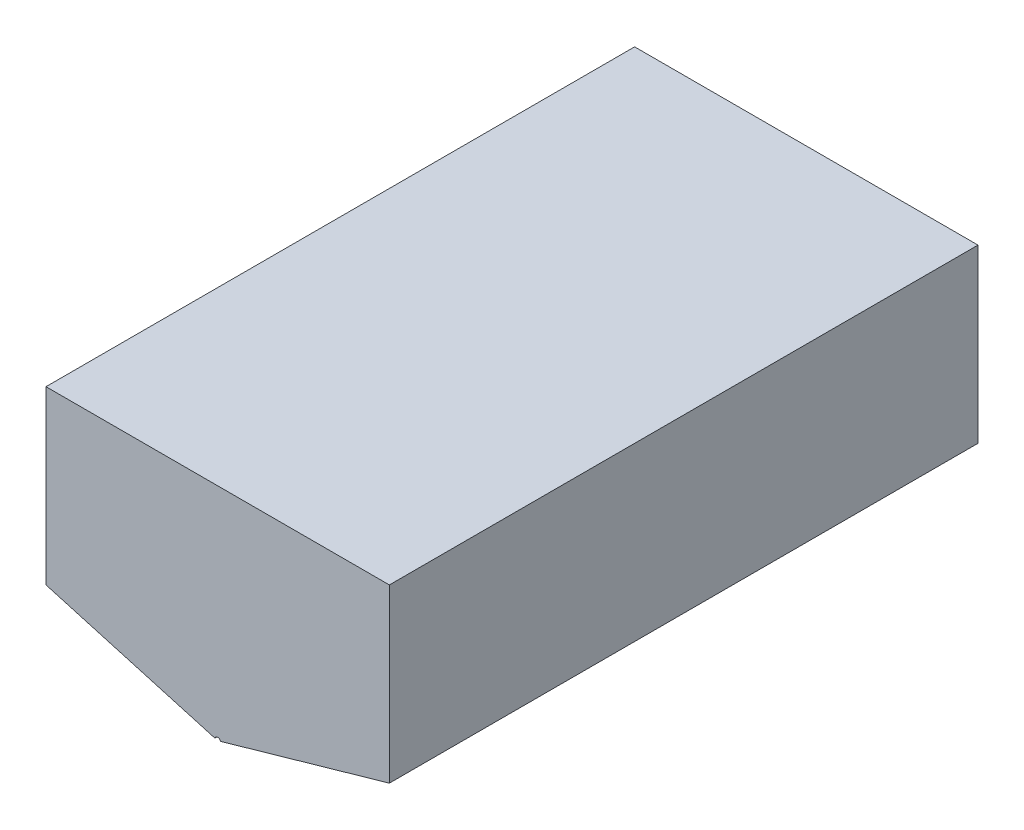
from build123d import *

# Parameters (mm, degrees)
RESSALTO_EXTRUS_O1_DEPTH = 120
ESBO_O3_R                = 0.6
CORTE_EXTRUS_O1_DEPTH    = 30


with BuildPart() as part:
    # Esbo_o1 → Ressalto-extrus_o1 (new body)
    with BuildSketch(Plane.XY):
        with BuildLine():
            Line((35, -12.5), (35, 22.5))
            Line((35, 22.5), (-35, 22.5))
            Line((-35, 22.5), (-35, -12.5))
            Line((-35, -12.5), (-0.384609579, -22.390111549))
            ThreePointArc((-0.384609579, -22.390111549), (0, -22.1), (0.384609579, -22.390111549))
            Line((0.384609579, -22.390111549), (35, -12.5))
        make_face()
    extrude(amount=RESSALTO_EXTRUS_O1_DEPTH)

    # Esbo_o3 → Corte-extrus_o1 (cut)
    with BuildSketch(Plane.XY.offset(120)):
        with Locations((0, -22.5)):
            Circle(ESBO_O3_R)
    extrude(amount=-CORTE_EXTRUS_O1_DEPTH, mode=Mode.SUBTRACT)


solid = part.part
